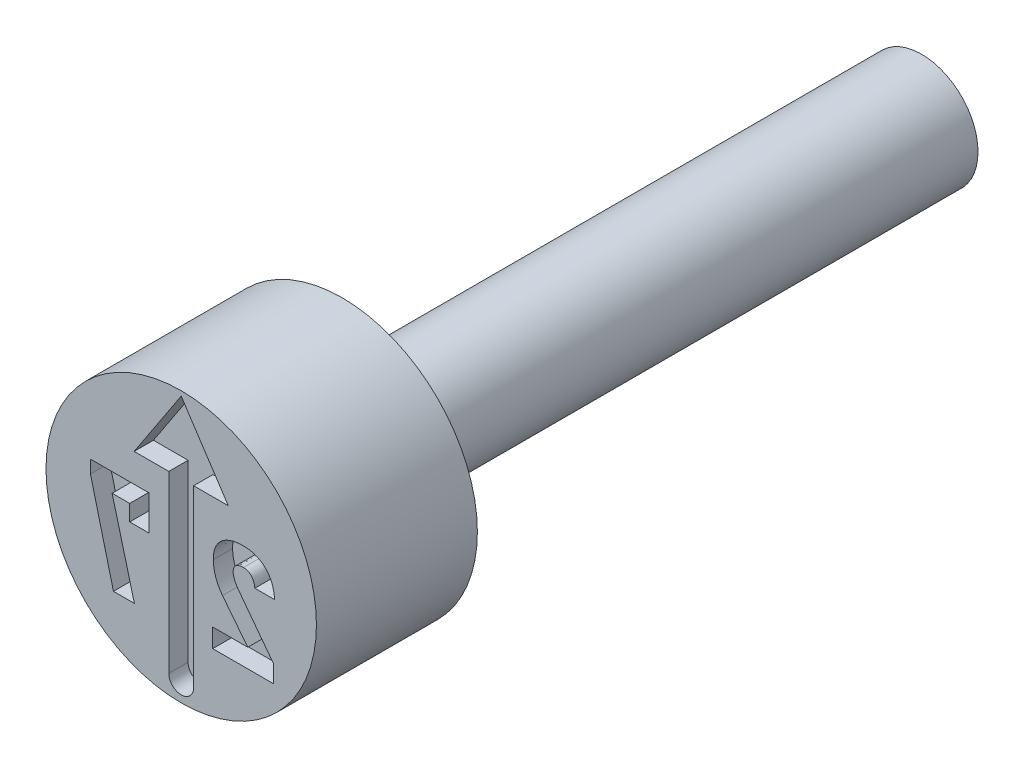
ISO-10303-21;
HEADER;
FILE_DESCRIPTION(('STEP AP214'),'2;1');
FILE_NAME('part.step','',(''),(''),'','','');
FILE_SCHEMA(('AUTOMOTIVE_DESIGN { 1 0 10303 214 1 1 1 1 }'));
ENDSEC;
DATA;
#1=APPLICATION_CONTEXT('core data for automotive mechanical design processes');
#2=APPLICATION_PROTOCOL_DEFINITION('international standard','automotive_design',2000,#1);
#3=PRODUCT_CONTEXT('',#1,'mechanical');
#4=PRODUCT('Part','Part','',(#3));
#5=PRODUCT_RELATED_PRODUCT_CATEGORY('part','',(#4));
#6=PRODUCT_DEFINITION_FORMATION('','',#4);
#7=PRODUCT_DEFINITION_CONTEXT('part definition',#1,'design');
#8=PRODUCT_DEFINITION('design','',#6,#7);
#9=PRODUCT_DEFINITION_SHAPE('','',#8);
#10=(LENGTH_UNIT() NAMED_UNIT(*) SI_UNIT(.MILLI.,.METRE.));
#11=(NAMED_UNIT(*) PLANE_ANGLE_UNIT() SI_UNIT($,.RADIAN.));
#12=(NAMED_UNIT(*) SI_UNIT($,.STERADIAN.) SOLID_ANGLE_UNIT());
#13=UNCERTAINTY_MEASURE_WITH_UNIT(LENGTH_MEASURE(1.E-05),#10,'distance_accuracy_value','');
#14=(GEOMETRIC_REPRESENTATION_CONTEXT(3) GLOBAL_UNCERTAINTY_ASSIGNED_CONTEXT((#13)) GLOBAL_UNIT_ASSIGNED_CONTEXT((#10,
#11,#12)) REPRESENTATION_CONTEXT('',''));
#15=CARTESIAN_POINT('',(0.,0.,0.));
#16=DIRECTION('',(0.,0.,1.));
#17=DIRECTION('',(1.,0.,0.));
#18=AXIS2_PLACEMENT_3D('',#15,#16,#17);
#19=CARTESIAN_POINT('',(0.,1.75,-5.));
#20=DIRECTION('',(0.,0.,1.));
#21=DIRECTION('',(1.,0.,0.));
#22=AXIS2_PLACEMENT_3D('',#19,#20,#21);
#23=PLANE('',#22);
#24=CARTESIAN_POINT('',(0.,0.,-5.));
#25=DIRECTION('',(0.,0.,1.));
#26=DIRECTION('',(1.,0.,0.));
#27=AXIS2_PLACEMENT_3D('',#24,#25,#26);
#28=CIRCLE('',#27,4.2);
#29=CARTESIAN_POINT('',(4.2,0.,-5.));
#30=VERTEX_POINT('',#29);
#31=EDGE_CURVE('E11',#30,#30,#28,.T.);
#32=ORIENTED_EDGE('',*,*,#31,.F.);
#33=EDGE_LOOP('',(#32));
#34=FACE_BOUND('',#33,.T.);
#35=CARTESIAN_POINT('',(0.,0.,-5.));
#36=DIRECTION('',(0.,0.,1.));
#37=DIRECTION('',(1.,0.,0.));
#38=AXIS2_PLACEMENT_3D('',#35,#36,#37);
#39=CIRCLE('',#38,1.75);
#40=CARTESIAN_POINT('',(1.75,0.,-5.));
#41=VERTEX_POINT('',#40);
#42=EDGE_CURVE('E405',#41,#41,#39,.T.);
#43=ORIENTED_EDGE('',*,*,#42,.T.);
#44=EDGE_LOOP('',(#43));
#45=FACE_BOUND('',#44,.T.);
#46=ADVANCED_FACE('F39',(#34,#45),#23,.F.);
#47=CARTESIAN_POINT('',(0.,0.,-0.403888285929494));
#48=DIRECTION('',(0.,0.,1.));
#49=DIRECTION('',(1.,0.,0.));
#50=AXIS2_PLACEMENT_3D('',#47,#48,#49);
#51=CYLINDRICAL_SURFACE('',#50,4.2);
#52=CARTESIAN_POINT('',(0.,0.,0.));
#53=DIRECTION('',(0.,0.,1.));
#54=DIRECTION('',(1.,0.,0.));
#55=AXIS2_PLACEMENT_3D('',#52,#53,#54);
#56=CIRCLE('',#55,4.2);
#57=CARTESIAN_POINT('',(4.2,0.,0.));
#58=VERTEX_POINT('',#57);
#59=EDGE_CURVE('E46',#58,#58,#56,.T.);
#60=ORIENTED_EDGE('',*,*,#59,.F.);
#61=EDGE_LOOP('',(#60));
#62=FACE_BOUND('',#61,.T.);
#63=ORIENTED_EDGE('',*,*,#31,.T.);
#64=EDGE_LOOP('',(#63));
#65=FACE_BOUND('',#64,.T.);
#66=ADVANCED_FACE('F390',(#62,#65),#51,.T.);
#67=CARTESIAN_POINT('',(0.,4.2,0.));
#68=DIRECTION('',(0.,0.,-1.));
#69=DIRECTION('',(-1.,0.,0.));
#70=AXIS2_PLACEMENT_3D('',#67,#68,#69);
#71=PLANE('',#70);
#72=DIRECTION('',(0.,1.,0.));
#73=VECTOR('',#72,1.);
#74=CARTESIAN_POINT('',(2.86298701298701,-2.25,0.));
#75=LINE('',#74,#73);
#76=CARTESIAN_POINT('',(2.86298701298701,-2.25,0.));
#77=VERTEX_POINT('',#76);
#78=CARTESIAN_POINT('',(2.86298701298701,-1.70584415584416,0.));
#79=VERTEX_POINT('',#78);
#80=EDGE_CURVE('E640',#77,#79,#75,.T.);
#81=ORIENTED_EDGE('',*,*,#80,.F.);
#82=DIRECTION('',(1.,0.,0.));
#83=VECTOR('',#82,1.);
#84=CARTESIAN_POINT('',(0.978571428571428,-2.25,0.));
#85=LINE('',#84,#83);
#86=CARTESIAN_POINT('',(0.978571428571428,-2.25,0.));
#87=VERTEX_POINT('',#86);
#88=EDGE_CURVE('E53',#87,#77,#85,.T.);
#89=ORIENTED_EDGE('',*,*,#88,.F.);
#90=DIRECTION('',(0.,-1.,0.));
#91=VECTOR('',#90,1.);
#92=CARTESIAN_POINT('',(0.978571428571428,-1.66818181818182,0.));
#93=LINE('',#92,#91);
#94=CARTESIAN_POINT('',(0.978571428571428,-1.66818181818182,0.));
#95=VERTEX_POINT('',#94);
#96=EDGE_CURVE('E274',#95,#87,#93,.T.);
#97=ORIENTED_EDGE('',*,*,#96,.F.);
#98=DIRECTION('',(-1.,0.,0.));
#99=VECTOR('',#98,1.);
#100=CARTESIAN_POINT('',(2.06753246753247,-1.66818181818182,0.));
#101=LINE('',#100,#99);
#102=CARTESIAN_POINT('',(2.06753246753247,-1.66818181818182,0.));
#103=VERTEX_POINT('',#102);
#104=EDGE_CURVE('E277',#103,#95,#101,.T.);
#105=ORIENTED_EDGE('',*,*,#104,.F.);
#106=DIRECTION('',(0.618183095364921,-0.786034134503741,0.));
#107=VECTOR('',#106,1.);
#108=CARTESIAN_POINT('',(1.28311688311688,-0.67077922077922,0.));
#109=LINE('',#108,#107);
#110=CARTESIAN_POINT('',(1.28311688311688,-0.67077922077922,0.));
#111=VERTEX_POINT('',#110);
#112=EDGE_CURVE('E571',#111,#103,#109,.T.);
#113=ORIENTED_EDGE('',*,*,#112,.F.);
#114=CARTESIAN_POINT('',(0.996103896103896,0.152597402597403,0.));
#115=CARTESIAN_POINT('',(0.996931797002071,0.116187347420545,0.));
#116=CARTESIAN_POINT('',(0.998589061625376,0.0433029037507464,0.));
#117=CARTESIAN_POINT('',(1.01354853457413,-0.0657788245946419,0.));
#118=CARTESIAN_POINT('',(1.03765543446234,-0.174303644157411,0.));
#119=CARTESIAN_POINT('',(1.0707627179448,-0.281747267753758,0.));
#120=CARTESIAN_POINT('',(1.11189043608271,-0.386248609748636,0.));
#121=CARTESIAN_POINT('',(1.16125160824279,-0.486376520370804,0.));
#122=CARTESIAN_POINT('',(1.21696202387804,-0.582175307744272,0.));
#123=CARTESIAN_POINT('',(1.2611074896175,-0.641301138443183,0.));
#124=CARTESIAN_POINT('',(1.28311688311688,-0.67077922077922,0.));
#125=B_SPLINE_CURVE_WITH_KNOTS('',3,(#114,#115,#116,#117,#118,#119,#120,#121,#122,#123,#124),
.UNSPECIFIED.,.F.,.F.,(4,1,1,1,1,1,1,1,4),(0.,0.123046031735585,0.246309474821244,
0.371480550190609,0.498560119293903,0.626024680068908,0.750715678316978,0.875715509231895,1.),.UNSPECIFIED.);
#126=CARTESIAN_POINT('',(0.996103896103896,0.152597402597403,0.));
#127=VERTEX_POINT('',#126);
#128=EDGE_CURVE('E574',#127,#111,#125,.T.);
#129=ORIENTED_EDGE('',*,*,#128,.F.);
#130=DIRECTION('',(0.,-1.,0.));
#131=VECTOR('',#130,1.);
#132=CARTESIAN_POINT('',(0.996103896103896,0.155194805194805,0.));
#133=LINE('',#132,#131);
#134=CARTESIAN_POINT('',(0.996103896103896,0.155194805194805,0.));
#135=VERTEX_POINT('',#134);
#136=EDGE_CURVE('E579',#135,#127,#133,.T.);
#137=ORIENTED_EDGE('',*,*,#136,.F.);
#138=CARTESIAN_POINT('',(1.93831168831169,0.991558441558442,0.));
#139=CARTESIAN_POINT('',(1.90191870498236,0.991041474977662,0.));
#140=CARTESIAN_POINT('',(1.83113916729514,0.990036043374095,0.));
#141=CARTESIAN_POINT('',(1.72809640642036,0.979182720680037,0.));
#142=CARTESIAN_POINT('',(1.63114409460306,0.962801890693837,0.));
#143=CARTESIAN_POINT('',(1.54043824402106,0.938837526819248,0.));
#144=CARTESIAN_POINT('',(1.45634299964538,0.907578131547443,0.));
#145=CARTESIAN_POINT('',(1.37860644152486,0.869886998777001,0.));
#146=CARTESIAN_POINT('',(1.30706606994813,0.825442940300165,0.));
#147=CARTESIAN_POINT('',(1.24226977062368,0.774150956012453,0.));
#148=CARTESIAN_POINT('',(1.18396911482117,0.716942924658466,0.));
#149=CARTESIAN_POINT('',(1.13378797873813,0.653238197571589,0.));
#150=CARTESIAN_POINT('',(1.09034788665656,0.584324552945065,0.));
#151=CARTESIAN_POINT('',(1.05639106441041,0.508865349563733,0.));
#152=CARTESIAN_POINT('',(1.02843507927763,0.42863512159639,0.));
#153=CARTESIAN_POINT('',(1.01033401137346,0.342195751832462,0.));
#154=CARTESIAN_POINT('',(0.998136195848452,0.250564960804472,0.));
#155=CARTESIAN_POINT('',(0.996792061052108,0.18748846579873,0.));
#156=CARTESIAN_POINT('',(0.996103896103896,0.155194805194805,0.));
#157=B_SPLINE_CURVE_WITH_KNOTS('',3,(#138,#139,#140,#141,#142,#143,#144,#145,#146,#147,#148,
#149,#150,#151,#152,#153,#154,#155,#156),.UNSPECIFIED.,.F.,.F.,(4,1,1,1,1,1,1,1,1,1,1,1,1,1,1,1,
4),(0.,0.0762312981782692,0.148259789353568,0.216860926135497,0.28210063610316,
0.344528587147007,0.404571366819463,0.462840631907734,0.520642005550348,0.577409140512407,
0.633580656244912,0.690215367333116,0.747647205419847,0.806597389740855,0.867894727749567,
0.932365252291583,1.),.UNSPECIFIED.);
#158=CARTESIAN_POINT('',(1.93831168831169,0.991558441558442,0.));
#159=VERTEX_POINT('',#158);
#160=EDGE_CURVE('E585',#159,#135,#157,.T.);
#161=ORIENTED_EDGE('',*,*,#160,.F.);
#162=CARTESIAN_POINT('',(2.9025974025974,0.0311688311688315,0.));
#163=CARTESIAN_POINT('',(2.89955987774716,0.0682613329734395,0.));
#164=CARTESIAN_POINT('',(2.8936306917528,0.140665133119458,0.));
#165=CARTESIAN_POINT('',(2.87419224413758,0.245400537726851,0.));
#166=CARTESIAN_POINT('',(2.84906881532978,0.344054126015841,0.));
#167=CARTESIAN_POINT('',(2.81710842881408,0.436606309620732,0.));
#168=CARTESIAN_POINT('',(2.77603921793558,0.521985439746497,0.));
#169=CARTESIAN_POINT('',(2.72989671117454,0.601976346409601,0.));
#170=CARTESIAN_POINT('',(2.67439883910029,0.674104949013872,0.));
#171=CARTESIAN_POINT('',(2.61364864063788,0.740784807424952,0.));
#172=CARTESIAN_POINT('',(2.54598378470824,0.799515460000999,0.));
#173=CARTESIAN_POINT('',(2.47383445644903,0.85132377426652,0.));
#174=CARTESIAN_POINT('',(2.39610964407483,0.894436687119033,0.));
#175=CARTESIAN_POINT('',(2.31399097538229,0.930201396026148,0.));
#176=CARTESIAN_POINT('',(2.22656798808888,0.957345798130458,0.));
#177=CARTESIAN_POINT('',(2.13498263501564,0.977679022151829,0.));
#178=CARTESIAN_POINT('',(2.03818368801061,0.989405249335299,0.));
#179=CARTESIAN_POINT('',(1.97210928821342,0.990829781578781,0.));
#180=CARTESIAN_POINT('',(1.93831168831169,0.991558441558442,0.));
#181=B_SPLINE_CURVE_WITH_KNOTS('',3,(#162,#163,#164,#165,#166,#167,#168,#169,#170,#171,#172,
#173,#174,#175,#176,#177,#178,#179,#180),.UNSPECIFIED.,.F.,.F.,(4,1,1,1,1,1,1,1,1,1,1,1,1,1,1,1,
4),(0.,0.0733268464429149,0.14313249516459,0.209679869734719,0.273918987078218,0.33576228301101,
0.396210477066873,0.45560885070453,0.514796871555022,0.573764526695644,0.631900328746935,
0.689592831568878,0.748648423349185,0.808163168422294,0.86976604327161,0.933384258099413,1.),.UNSPECIFIED.);
#182=CARTESIAN_POINT('',(2.9025974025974,0.0311688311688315,0.));
#183=VERTEX_POINT('',#182);
#184=EDGE_CURVE('E590',#183,#159,#181,.T.);
#185=ORIENTED_EDGE('',*,*,#184,.F.);
#186=DIRECTION('',(0.,1.,0.));
#187=VECTOR('',#186,1.);
#188=CARTESIAN_POINT('',(2.9025974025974,0.0292207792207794,0.));
#189=LINE('',#188,#187);
#190=CARTESIAN_POINT('',(2.9025974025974,0.0292207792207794,0.));
#191=VERTEX_POINT('',#190);
#192=EDGE_CURVE('E598',#191,#183,#189,.T.);
#193=ORIENTED_EDGE('',*,*,#192,.F.);
#194=DIRECTION('',(1.,0.,0.));
#195=VECTOR('',#194,1.);
#196=CARTESIAN_POINT('',(2.28701298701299,0.0292207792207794,0.));
#197=LINE('',#196,#195);
#198=CARTESIAN_POINT('',(2.28701298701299,0.0292207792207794,0.));
#199=VERTEX_POINT('',#198);
#200=EDGE_CURVE('E604',#199,#191,#197,.T.);
#201=ORIENTED_EDGE('',*,*,#200,.F.);
#202=DIRECTION('',(0.,-1.,0.));
#203=VECTOR('',#202,1.);
#204=CARTESIAN_POINT('',(2.28701298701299,0.0311688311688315,0.));
#205=LINE('',#204,#203);
#206=CARTESIAN_POINT('',(2.28701298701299,0.0311688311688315,0.));
#207=VERTEX_POINT('',#206);
#208=EDGE_CURVE('E607',#207,#199,#205,.T.);
#209=ORIENTED_EDGE('',*,*,#208,.F.);
#210=CARTESIAN_POINT('',(1.93376623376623,0.40974025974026,0.));
#211=CARTESIAN_POINT('',(1.95729092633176,0.408822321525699,0.));
#212=CARTESIAN_POINT('',(2.00300022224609,0.407038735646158,0.));
#213=CARTESIAN_POINT('',(2.06770952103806,0.38727157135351,0.));
#214=CARTESIAN_POINT('',(2.12601890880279,0.356265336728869,0.));
#215=CARTESIAN_POINT('',(2.17628623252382,0.312023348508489,0.));
#216=CARTESIAN_POINT('',(2.21791138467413,0.25647586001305,0.));
#217=CARTESIAN_POINT('',(2.25169422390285,0.191064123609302,0.));
#218=CARTESIAN_POINT('',(2.27463927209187,0.114607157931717,0.));
#219=CARTESIAN_POINT('',(2.28275569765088,0.059876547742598,0.));
#220=CARTESIAN_POINT('',(2.28701298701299,0.0311688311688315,0.));
#221=B_SPLINE_CURVE_WITH_KNOTS('',3,(#210,#211,#212,#213,#214,#215,#216,#217,#218,#219,#220),
.UNSPECIFIED.,.F.,.F.,(4,1,1,1,1,1,1,1,4),(0.,0.122603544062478,0.238222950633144,
0.350089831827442,0.465559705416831,0.58502806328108,0.711014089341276,0.848418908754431,1.),.UNSPECIFIED.);
#222=CARTESIAN_POINT('',(1.93376623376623,0.40974025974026,0.));
#223=VERTEX_POINT('',#222);
#224=EDGE_CURVE('E610',#223,#207,#221,.T.);
#225=ORIENTED_EDGE('',*,*,#224,.F.);
#226=CARTESIAN_POINT('',(1.61428571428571,0.138311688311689,0.));
#227=CARTESIAN_POINT('',(1.61517276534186,0.158772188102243,0.));
#228=CARTESIAN_POINT('',(1.61687221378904,0.19797124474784,0.));
#229=CARTESIAN_POINT('',(1.63288368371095,0.253203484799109,0.));
#230=CARTESIAN_POINT('',(1.65912562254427,0.30130232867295,0.));
#231=CARTESIAN_POINT('',(1.69671041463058,0.341031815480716,0.));
#232=CARTESIAN_POINT('',(1.74350060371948,0.372455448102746,0.));
#233=CARTESIAN_POINT('',(1.7994863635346,0.394600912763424,0.));
#234=CARTESIAN_POINT('',(1.8639351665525,0.407299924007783,0.));
#235=CARTESIAN_POINT('',(1.90968069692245,0.408898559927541,0.));
#236=CARTESIAN_POINT('',(1.93376623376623,0.40974025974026,0.));
#237=B_SPLINE_CURVE_WITH_KNOTS('',3,(#226,#227,#228,#229,#230,#231,#232,#233,#234,#235,#236),
.UNSPECIFIED.,.F.,.F.,(4,1,1,1,1,1,1,1,4),(0.,0.128749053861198,0.246662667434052,
0.359069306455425,0.47107757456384,0.588039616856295,0.711712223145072,0.848213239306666,1.),.UNSPECIFIED.);
#238=CARTESIAN_POINT('',(1.61428571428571,0.138311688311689,0.));
#239=VERTEX_POINT('',#238);
#240=EDGE_CURVE('E615',#239,#223,#237,.T.);
#241=ORIENTED_EDGE('',*,*,#240,.F.);
#242=DIRECTION('',(0.,1.,0.));
#243=VECTOR('',#242,1.);
#244=CARTESIAN_POINT('',(1.61428571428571,0.133766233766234,0.));
#245=LINE('',#244,#243);
#246=CARTESIAN_POINT('',(1.61428571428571,0.133766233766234,0.));
#247=VERTEX_POINT('',#246);
#248=EDGE_CURVE('E623',#247,#239,#245,.T.);
#249=ORIENTED_EDGE('',*,*,#248,.F.);
#250=CARTESIAN_POINT('',(1.76948051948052,-0.257142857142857,0.));
#251=CARTESIAN_POINT('',(1.74657683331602,-0.224870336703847,0.));
#252=CARTESIAN_POINT('',(1.70194969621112,-0.161988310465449,0.));
#253=CARTESIAN_POINT('',(1.66155869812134,-0.0756325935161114,0.));
#254=CARTESIAN_POINT('',(1.6363967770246,-0.00792863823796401,0.));
#255=CARTESIAN_POINT('',(1.62440516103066,0.0411700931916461,0.));
#256=CARTESIAN_POINT('',(1.61585071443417,0.0880148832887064,0.));
#257=CARTESIAN_POINT('',(1.61479780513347,0.118795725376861,0.));
#258=CARTESIAN_POINT('',(1.61428571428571,0.133766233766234,0.));
#259=B_SPLINE_CURVE_WITH_KNOTS('',3,(#250,#251,#252,#253,#254,#255,#256,#257,#258),
.UNSPECIFIED.,.F.,.F.,(4,1,1,1,1,1,4),(0.,0.277375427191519,0.540457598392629,0.666416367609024,
0.784009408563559,0.894951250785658,1.),.UNSPECIFIED.);
#260=CARTESIAN_POINT('',(1.76948051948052,-0.257142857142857,0.));
#261=VERTEX_POINT('',#260);
#262=EDGE_CURVE('E629',#261,#247,#259,.T.);
#263=ORIENTED_EDGE('',*,*,#262,.F.);
#264=DIRECTION('',(-0.602458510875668,0.798150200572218,0.));
#265=VECTOR('',#264,1.);
#266=CARTESIAN_POINT('',(2.86298701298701,-1.70584415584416,0.));
#267=LINE('',#266,#265);
#268=EDGE_CURVE('E634',#79,#261,#267,.T.);
#269=ORIENTED_EDGE('',*,*,#268,.F.);
#270=EDGE_LOOP('',(#81,#89,#97,#105,#113,#129,#137,#161,#185,#193,#201,#209,#225,#241,#249,#263,#269));
#271=FACE_BOUND('',#270,.T.);
#272=DIRECTION('',(0.,-1.,0.));
#273=VECTOR('',#272,1.);
#274=CARTESIAN_POINT('',(-2.81927272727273,0.95,0.));
#275=LINE('',#274,#273);
#276=CARTESIAN_POINT('',(-2.81927272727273,0.95,0.));
#277=VERTEX_POINT('',#276);
#278=CARTESIAN_POINT('',(-2.81927272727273,0.548701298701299,0.));
#279=VERTEX_POINT('',#278);
#280=EDGE_CURVE('E510',#277,#279,#275,.T.);
#281=ORIENTED_EDGE('',*,*,#280,.F.);
#282=DIRECTION('',(-1.,0.,0.));
#283=VECTOR('',#282,1.);
#284=CARTESIAN_POINT('',(-0.998493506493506,0.95,0.));
#285=LINE('',#284,#283);
#286=CARTESIAN_POINT('',(-0.998493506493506,0.95,0.));
#287=VERTEX_POINT('',#286);
#288=EDGE_CURVE('E61',#287,#277,#285,.T.);
#289=ORIENTED_EDGE('',*,*,#288,.F.);
#290=DIRECTION('',(0.,1.,0.));
#291=VECTOR('',#290,1.);
#292=CARTESIAN_POINT('',(-0.998493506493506,-0.13051948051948,0.));
#293=LINE('',#292,#291);
#294=CARTESIAN_POINT('',(-0.998493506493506,-0.13051948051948,0.));
#295=VERTEX_POINT('',#294);
#296=EDGE_CURVE('E488',#295,#287,#293,.T.);
#297=ORIENTED_EDGE('',*,*,#296,.F.);
#298=DIRECTION('',(1.,0.,0.));
#299=VECTOR('',#298,1.);
#300=CARTESIAN_POINT('',(-1.59914285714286,-0.13051948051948,0.));
#301=LINE('',#300,#299);
#302=CARTESIAN_POINT('',(-1.59914285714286,-0.13051948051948,0.));
#303=VERTEX_POINT('',#302);
#304=EDGE_CURVE('E492',#303,#295,#301,.T.);
#305=ORIENTED_EDGE('',*,*,#304,.F.);
#306=DIRECTION('',(0.,-1.,0.));
#307=VECTOR('',#306,1.);
#308=CARTESIAN_POINT('',(-1.59914285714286,0.368181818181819,0.));
#309=LINE('',#308,#307);
#310=CARTESIAN_POINT('',(-1.59914285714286,0.368181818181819,0.));
#311=VERTEX_POINT('',#310);
#312=EDGE_CURVE('E495',#311,#303,#309,.T.);
#313=ORIENTED_EDGE('',*,*,#312,.F.);
#314=DIRECTION('',(1.,0.,0.));
#315=VECTOR('',#314,1.);
#316=CARTESIAN_POINT('',(-2.14654545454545,0.368181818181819,0.));
#317=LINE('',#316,#315);
#318=CARTESIAN_POINT('',(-2.14654545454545,0.368181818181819,0.));
#319=VERTEX_POINT('',#318);
#320=EDGE_CURVE('E498',#319,#311,#317,.T.);
#321=ORIENTED_EDGE('',*,*,#320,.F.);
#322=DIRECTION('',(-0.255602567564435,0.966781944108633,0.));
#323=VECTOR('',#322,1.);
#324=CARTESIAN_POINT('',(-1.45433766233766,-2.25,0.));
#325=LINE('',#324,#323);
#326=CARTESIAN_POINT('',(-1.45433766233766,-2.25,0.));
#327=VERTEX_POINT('',#326);
#328=EDGE_CURVE('E501',#327,#319,#325,.T.);
#329=ORIENTED_EDGE('',*,*,#328,.F.);
#330=DIRECTION('',(1.,0.,0.));
#331=VECTOR('',#330,1.);
#332=CARTESIAN_POINT('',(-2.10498701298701,-2.25,0.));
#333=LINE('',#332,#331);
#334=CARTESIAN_POINT('',(-2.10498701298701,-2.25,0.));
#335=VERTEX_POINT('',#334);
#336=EDGE_CURVE('E504',#335,#327,#333,.T.);
#337=ORIENTED_EDGE('',*,*,#336,.F.);
#338=DIRECTION('',(0.247293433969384,-0.968940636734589,0.));
#339=VECTOR('',#338,1.);
#340=CARTESIAN_POINT('',(-2.81927272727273,0.548701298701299,0.));
#341=LINE('',#340,#339);
#342=EDGE_CURVE('E507',#279,#335,#341,.T.);
#343=ORIENTED_EDGE('',*,*,#342,.F.);
#344=EDGE_LOOP('',(#281,#289,#297,#305,#313,#321,#329,#337,#343));
#345=FACE_BOUND('',#344,.T.);
#346=DIRECTION('',(0.,1.,0.));
#347=VECTOR('',#346,1.);
#348=CARTESIAN_POINT('',(0.385708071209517,1.83536164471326,0.));
#349=LINE('',#348,#347);
#350=CARTESIAN_POINT('',(0.385708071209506,-3.59672771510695,0.));
#351=VERTEX_POINT('',#350);
#352=CARTESIAN_POINT('',(0.385708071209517,1.83536164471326,0.));
#353=VERTEX_POINT('',#352);
#354=EDGE_CURVE('E444',#351,#353,#349,.T.);
#355=ORIENTED_EDGE('',*,*,#354,.F.);
#356=CARTESIAN_POINT('',(3.30934598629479E-13,-3.59672771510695,0.));
#357=DIRECTION('',(0.,0.,1.));
#358=DIRECTION('',(1.,0.,0.));
#359=AXIS2_PLACEMENT_3D('',#356,#357,#358);
#360=CIRCLE('',#359,0.385708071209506);
#361=CARTESIAN_POINT('',(-0.385708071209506,-3.59672771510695,0.));
#362=VERTEX_POINT('',#361);
#363=EDGE_CURVE('E447',#362,#351,#360,.T.);
#364=ORIENTED_EDGE('',*,*,#363,.F.);
#365=DIRECTION('',(0.,-1.,0.));
#366=VECTOR('',#365,1.);
#367=CARTESIAN_POINT('',(-0.385708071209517,1.83536164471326,0.));
#368=LINE('',#367,#366);
#369=CARTESIAN_POINT('',(-0.385708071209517,1.83536164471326,0.));
#370=VERTEX_POINT('',#369);
#371=EDGE_CURVE('E428',#370,#362,#368,.T.);
#372=ORIENTED_EDGE('',*,*,#371,.F.);
#373=DIRECTION('',(1.,0.,0.));
#374=VECTOR('',#373,1.);
#375=CARTESIAN_POINT('',(-1.46188328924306,1.83536164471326,0.));
#376=LINE('',#375,#374);
#377=CARTESIAN_POINT('',(-1.46188328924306,1.83536164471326,0.));
#378=VERTEX_POINT('',#377);
#379=EDGE_CURVE('E432',#378,#370,#376,.T.);
#380=ORIENTED_EDGE('',*,*,#379,.F.);
#381=DIRECTION('',(-0.550159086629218,-0.835059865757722,0.));
#382=VECTOR('',#381,1.);
#383=CARTESIAN_POINT('',(0.,4.05428357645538,0.));
#384=LINE('',#383,#382);
#385=CARTESIAN_POINT('',(0.,4.05428357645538,0.));
#386=VERTEX_POINT('',#385);
#387=EDGE_CURVE('E435',#386,#378,#384,.T.);
#388=ORIENTED_EDGE('',*,*,#387,.F.);
#389=DIRECTION('',(-0.550159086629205,0.835059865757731,0.));
#390=VECTOR('',#389,1.);
#391=CARTESIAN_POINT('',(0.,4.05428357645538,0.));
#392=LINE('',#391,#390);
#393=CARTESIAN_POINT('',(1.46188328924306,1.83536164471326,0.));
#394=VERTEX_POINT('',#393);
#395=EDGE_CURVE('E438',#394,#386,#392,.T.);
#396=ORIENTED_EDGE('',*,*,#395,.F.);
#397=DIRECTION('',(1.,0.,0.));
#398=VECTOR('',#397,1.);
#399=CARTESIAN_POINT('',(1.46188328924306,1.83536164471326,0.));
#400=LINE('',#399,#398);
#401=EDGE_CURVE('E441',#353,#394,#400,.T.);
#402=ORIENTED_EDGE('',*,*,#401,.F.);
#403=EDGE_LOOP('',(#355,#364,#372,#380,#388,#396,#402));
#404=FACE_BOUND('',#403,.T.);
#405=ORIENTED_EDGE('',*,*,#59,.T.);
#406=EDGE_LOOP('',(#405));
#407=FACE_BOUND('',#406,.T.);
#408=ADVANCED_FACE('F387',(#271,#345,#404,#407),#71,.F.);
#409=CARTESIAN_POINT('',(0.,0.,-23.));
#410=DIRECTION('',(0.,0.,1.));
#411=DIRECTION('',(1.,0.,0.));
#412=AXIS2_PLACEMENT_3D('',#409,#410,#411);
#413=PLANE('',#412);
#414=CARTESIAN_POINT('',(0.,0.,-23.));
#415=DIRECTION('',(0.,0.,1.));
#416=DIRECTION('',(1.,0.,0.));
#417=AXIS2_PLACEMENT_3D('',#414,#415,#416);
#418=CIRCLE('',#417,1.75);
#419=CARTESIAN_POINT('',(1.75,0.,-23.));
#420=VERTEX_POINT('',#419);
#421=EDGE_CURVE('E406',#420,#420,#418,.T.);
#422=ORIENTED_EDGE('',*,*,#421,.F.);
#423=EDGE_LOOP('',(#422));
#424=FACE_BOUND('',#423,.T.);
#425=ADVANCED_FACE('F383',(#424),#413,.F.);
#426=CARTESIAN_POINT('',(0.,0.,-0.403888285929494));
#427=DIRECTION('',(0.,0.,1.));
#428=DIRECTION('',(1.,0.,0.));
#429=AXIS2_PLACEMENT_3D('',#426,#427,#428);
#430=CYLINDRICAL_SURFACE('',#429,1.75);
#431=ORIENTED_EDGE('',*,*,#42,.F.);
#432=EDGE_LOOP('',(#431));
#433=FACE_BOUND('',#432,.T.);
#434=ORIENTED_EDGE('',*,*,#421,.T.);
#435=EDGE_LOOP('',(#434));
#436=FACE_BOUND('',#435,.T.);
#437=ADVANCED_FACE('F379',(#433,#436),#430,.T.);
#438=CARTESIAN_POINT('',(3.30934598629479E-13,-3.59672771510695,-0.6));
#439=DIRECTION('',(0.,0.,1.));
#440=DIRECTION('',(1.,0.,0.));
#441=AXIS2_PLACEMENT_3D('',#438,#439,#440);
#442=CYLINDRICAL_SURFACE('',#441,0.385708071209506);
#443=ORIENTED_EDGE('',*,*,#363,.T.);
#444=DIRECTION('',(0.,0.,1.));
#445=VECTOR('',#444,1.);
#446=CARTESIAN_POINT('',(0.385708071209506,-3.59672771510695,-0.6));
#447=LINE('',#446,#445);
#448=CARTESIAN_POINT('',(0.385708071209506,-3.59672771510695,-0.6));
#449=VERTEX_POINT('',#448);
#450=EDGE_CURVE('E414',#449,#351,#447,.T.);
#451=ORIENTED_EDGE('',*,*,#450,.F.);
#452=CARTESIAN_POINT('',(3.30934598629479E-13,-3.59672771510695,-0.6));
#453=DIRECTION('',(0.,0.,1.));
#454=DIRECTION('',(1.,0.,0.));
#455=AXIS2_PLACEMENT_3D('',#452,#453,#454);
#456=CIRCLE('',#455,0.385708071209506);
#457=CARTESIAN_POINT('',(-0.385708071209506,-3.59672771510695,-0.6));
#458=VERTEX_POINT('',#457);
#459=EDGE_CURVE('E431',#458,#449,#456,.T.);
#460=ORIENTED_EDGE('',*,*,#459,.F.);
#461=DIRECTION('',(0.,0.,1.));
#462=VECTOR('',#461,1.);
#463=CARTESIAN_POINT('',(-0.385708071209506,-3.59672771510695,-0.6));
#464=LINE('',#463,#462);
#465=EDGE_CURVE('E407',#458,#362,#464,.T.);
#466=ORIENTED_EDGE('',*,*,#465,.T.);
#467=EDGE_LOOP('',(#443,#451,#460,#466));
#468=FACE_BOUND('',#467,.T.);
#469=ADVANCED_FACE('F357',(#468),#442,.F.);
#470=CARTESIAN_POINT('',(-0.385708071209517,1.83536164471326,-0.6));
#471=DIRECTION('',(-1.,0.,0.));
#472=DIRECTION('',(0.,-1.,0.));
#473=AXIS2_PLACEMENT_3D('',#470,#471,#472);
#474=PLANE('',#473);
#475=ORIENTED_EDGE('',*,*,#371,.T.);
#476=ORIENTED_EDGE('',*,*,#465,.F.);
#477=DIRECTION('',(0.,-1.,0.));
#478=VECTOR('',#477,1.);
#479=CARTESIAN_POINT('',(-0.385708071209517,1.83536164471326,-0.6));
#480=LINE('',#479,#478);
#481=CARTESIAN_POINT('',(-0.385708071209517,1.83536164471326,-0.6));
#482=VERTEX_POINT('',#481);
#483=EDGE_CURVE('E419',#482,#458,#480,.T.);
#484=ORIENTED_EDGE('',*,*,#483,.F.);
#485=DIRECTION('',(0.,0.,1.));
#486=VECTOR('',#485,1.);
#487=CARTESIAN_POINT('',(-0.385708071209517,1.83536164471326,-0.6));
#488=LINE('',#487,#486);
#489=EDGE_CURVE('E411',#482,#370,#488,.T.);
#490=ORIENTED_EDGE('',*,*,#489,.T.);
#491=EDGE_LOOP('',(#475,#476,#484,#490));
#492=FACE_BOUND('',#491,.T.);
#493=ADVANCED_FACE('F353',(#492),#474,.F.);
#494=CARTESIAN_POINT('',(-1.46188328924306,1.83536164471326,-0.6));
#495=DIRECTION('',(0.,-1.,0.));
#496=DIRECTION('',(0.,0.,-1.));
#497=AXIS2_PLACEMENT_3D('',#494,#495,#496);
#498=PLANE('',#497);
#499=ORIENTED_EDGE('',*,*,#379,.T.);
#500=ORIENTED_EDGE('',*,*,#489,.F.);
#501=DIRECTION('',(1.,0.,0.));
#502=VECTOR('',#501,1.);
#503=CARTESIAN_POINT('',(-1.46188328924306,1.83536164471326,-0.6));
#504=LINE('',#503,#502);
#505=CARTESIAN_POINT('',(-1.46188328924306,1.83536164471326,-0.6));
#506=VERTEX_POINT('',#505);
#507=EDGE_CURVE('E452',#506,#482,#504,.T.);
#508=ORIENTED_EDGE('',*,*,#507,.F.);
#509=DIRECTION('',(0.,0.,1.));
#510=VECTOR('',#509,1.);
#511=CARTESIAN_POINT('',(-1.46188328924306,1.83536164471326,-0.6));
#512=LINE('',#511,#510);
#513=EDGE_CURVE('E425',#506,#378,#512,.T.);
#514=ORIENTED_EDGE('',*,*,#513,.T.);
#515=EDGE_LOOP('',(#499,#500,#508,#514));
#516=FACE_BOUND('',#515,.T.);
#517=ADVANCED_FACE('F356',(#516),#498,.F.);
#518=CARTESIAN_POINT('',(0.,4.05428357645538,-0.6));
#519=DIRECTION('',(-0.835059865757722,0.550159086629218,0.));
#520=DIRECTION('',(-0.550159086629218,-0.835059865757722,0.));
#521=AXIS2_PLACEMENT_3D('',#518,#519,#520);
#522=PLANE('',#521);
#523=ORIENTED_EDGE('',*,*,#387,.T.);
#524=ORIENTED_EDGE('',*,*,#513,.F.);
#525=DIRECTION('',(-0.550159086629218,-0.835059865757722,0.));
#526=VECTOR('',#525,1.);
#527=CARTESIAN_POINT('',(0.,4.05428357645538,-0.6));
#528=LINE('',#527,#526);
#529=CARTESIAN_POINT('',(0.,4.05428357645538,-0.6));
#530=VERTEX_POINT('',#529);
#531=EDGE_CURVE('E455',#530,#506,#528,.T.);
#532=ORIENTED_EDGE('',*,*,#531,.F.);
#533=DIRECTION('',(0.,0.,1.));
#534=VECTOR('',#533,1.);
#535=CARTESIAN_POINT('',(0.,4.05428357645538,-0.6));
#536=LINE('',#535,#534);
#537=EDGE_CURVE('E423',#530,#386,#536,.T.);
#538=ORIENTED_EDGE('',*,*,#537,.T.);
#539=EDGE_LOOP('',(#523,#524,#532,#538));
#540=FACE_BOUND('',#539,.T.);
#541=ADVANCED_FACE('F361',(#540),#522,.F.);
#542=CARTESIAN_POINT('',(0.,4.05428357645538,-0.6));
#543=DIRECTION('',(0.835059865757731,0.550159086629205,0.));
#544=DIRECTION('',(-0.550159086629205,0.835059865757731,0.));
#545=AXIS2_PLACEMENT_3D('',#542,#543,#544);
#546=PLANE('',#545);
#547=ORIENTED_EDGE('',*,*,#395,.T.);
#548=ORIENTED_EDGE('',*,*,#537,.F.);
#549=DIRECTION('',(-0.550159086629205,0.835059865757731,0.));
#550=VECTOR('',#549,1.);
#551=CARTESIAN_POINT('',(0.,4.05428357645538,-0.6));
#552=LINE('',#551,#550);
#553=CARTESIAN_POINT('',(1.46188328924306,1.83536164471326,-0.6));
#554=VERTEX_POINT('',#553);
#555=EDGE_CURVE('E458',#554,#530,#552,.T.);
#556=ORIENTED_EDGE('',*,*,#555,.F.);
#557=DIRECTION('',(0.,0.,1.));
#558=VECTOR('',#557,1.);
#559=CARTESIAN_POINT('',(1.46188328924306,1.83536164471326,-0.6));
#560=LINE('',#559,#558);
#561=EDGE_CURVE('E421',#554,#394,#560,.T.);
#562=ORIENTED_EDGE('',*,*,#561,.T.);
#563=EDGE_LOOP('',(#547,#548,#556,#562));
#564=FACE_BOUND('',#563,.T.);
#565=ADVANCED_FACE('F365',(#564),#546,.F.);
#566=CARTESIAN_POINT('',(1.46188328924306,1.83536164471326,-0.6));
#567=DIRECTION('',(0.,-1.,0.));
#568=DIRECTION('',(0.,0.,-1.));
#569=AXIS2_PLACEMENT_3D('',#566,#567,#568);
#570=PLANE('',#569);
#571=ORIENTED_EDGE('',*,*,#401,.T.);
#572=ORIENTED_EDGE('',*,*,#561,.F.);
#573=DIRECTION('',(1.,0.,0.));
#574=VECTOR('',#573,1.);
#575=CARTESIAN_POINT('',(1.46188328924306,1.83536164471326,-0.6));
#576=LINE('',#575,#574);
#577=CARTESIAN_POINT('',(0.385708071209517,1.83536164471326,-0.6));
#578=VERTEX_POINT('',#577);
#579=EDGE_CURVE('E461',#578,#554,#576,.T.);
#580=ORIENTED_EDGE('',*,*,#579,.F.);
#581=DIRECTION('',(0.,0.,1.));
#582=VECTOR('',#581,1.);
#583=CARTESIAN_POINT('',(0.385708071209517,1.83536164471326,-0.6));
#584=LINE('',#583,#582);
#585=EDGE_CURVE('E418',#578,#353,#584,.T.);
#586=ORIENTED_EDGE('',*,*,#585,.T.);
#587=EDGE_LOOP('',(#571,#572,#580,#586));
#588=FACE_BOUND('',#587,.T.);
#589=ADVANCED_FACE('F369',(#588),#570,.F.);
#590=CARTESIAN_POINT('',(0.385708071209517,1.83536164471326,-0.6));
#591=DIRECTION('',(1.,0.,0.));
#592=DIRECTION('',(0.,1.,0.));
#593=AXIS2_PLACEMENT_3D('',#590,#591,#592);
#594=PLANE('',#593);
#595=ORIENTED_EDGE('',*,*,#354,.T.);
#596=ORIENTED_EDGE('',*,*,#585,.F.);
#597=DIRECTION('',(0.,1.,0.));
#598=VECTOR('',#597,1.);
#599=CARTESIAN_POINT('',(0.385708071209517,1.83536164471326,-0.6));
#600=LINE('',#599,#598);
#601=EDGE_CURVE('E464',#449,#578,#600,.T.);
#602=ORIENTED_EDGE('',*,*,#601,.F.);
#603=ORIENTED_EDGE('',*,*,#450,.T.);
#604=EDGE_LOOP('',(#595,#596,#602,#603));
#605=FACE_BOUND('',#604,.T.);
#606=ADVANCED_FACE('F351',(#605),#594,.F.);
#607=CARTESIAN_POINT('',(3.30934598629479E-13,-3.59672771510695,-0.6));
#608=DIRECTION('',(0.,0.,1.));
#609=DIRECTION('',(1.,0.,0.));
#610=AXIS2_PLACEMENT_3D('',#607,#608,#609);
#611=PLANE('',#610);
#612=ORIENTED_EDGE('',*,*,#459,.T.);
#613=ORIENTED_EDGE('',*,*,#601,.T.);
#614=ORIENTED_EDGE('',*,*,#579,.T.);
#615=ORIENTED_EDGE('',*,*,#555,.T.);
#616=ORIENTED_EDGE('',*,*,#531,.T.);
#617=ORIENTED_EDGE('',*,*,#507,.T.);
#618=ORIENTED_EDGE('',*,*,#483,.T.);
#619=EDGE_LOOP('',(#612,#613,#614,#615,#616,#617,#618));
#620=FACE_BOUND('',#619,.T.);
#621=ADVANCED_FACE('F348',(#620),#611,.T.);
#622=CARTESIAN_POINT('',(-0.998493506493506,0.95,-0.6));
#623=DIRECTION('',(0.,1.,0.));
#624=DIRECTION('',(0.,0.,1.));
#625=AXIS2_PLACEMENT_3D('',#622,#623,#624);
#626=PLANE('',#625);
#627=ORIENTED_EDGE('',*,*,#288,.T.);
#628=DIRECTION('',(0.,0.,1.));
#629=VECTOR('',#628,1.);
#630=CARTESIAN_POINT('',(-2.81927272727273,0.95,-0.6));
#631=LINE('',#630,#629);
#632=CARTESIAN_POINT('',(-2.81927272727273,0.95,-0.6));
#633=VERTEX_POINT('',#632);
#634=EDGE_CURVE('E469',#633,#277,#631,.T.);
#635=ORIENTED_EDGE('',*,*,#634,.F.);
#636=DIRECTION('',(-1.,0.,0.));
#637=VECTOR('',#636,1.);
#638=CARTESIAN_POINT('',(-0.998493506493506,0.95,-0.6));
#639=LINE('',#638,#637);
#640=CARTESIAN_POINT('',(-0.998493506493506,0.95,-0.6));
#641=VERTEX_POINT('',#640);
#642=EDGE_CURVE('E491',#641,#633,#639,.T.);
#643=ORIENTED_EDGE('',*,*,#642,.F.);
#644=DIRECTION('',(0.,0.,1.));
#645=VECTOR('',#644,1.);
#646=CARTESIAN_POINT('',(-0.998493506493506,0.95,-0.6));
#647=LINE('',#646,#645);
#648=EDGE_CURVE('E486',#641,#287,#647,.T.);
#649=ORIENTED_EDGE('',*,*,#648,.T.);
#650=EDGE_LOOP('',(#627,#635,#643,#649));
#651=FACE_BOUND('',#650,.T.);
#652=ADVANCED_FACE('F318',(#651),#626,.F.);
#653=CARTESIAN_POINT('',(-0.998493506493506,-0.13051948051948,-0.6));
#654=DIRECTION('',(1.,0.,0.));
#655=DIRECTION('',(0.,0.,-1.));
#656=AXIS2_PLACEMENT_3D('',#653,#654,#655);
#657=PLANE('',#656);
#658=ORIENTED_EDGE('',*,*,#296,.T.);
#659=ORIENTED_EDGE('',*,*,#648,.F.);
#660=DIRECTION('',(0.,1.,0.));
#661=VECTOR('',#660,1.);
#662=CARTESIAN_POINT('',(-0.998493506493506,-0.13051948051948,-0.6));
#663=LINE('',#662,#661);
#664=CARTESIAN_POINT('',(-0.998493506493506,-0.13051948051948,-0.6));
#665=VERTEX_POINT('',#664);
#666=EDGE_CURVE('E472',#665,#641,#663,.T.);
#667=ORIENTED_EDGE('',*,*,#666,.F.);
#668=DIRECTION('',(0.,0.,1.));
#669=VECTOR('',#668,1.);
#670=CARTESIAN_POINT('',(-0.998493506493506,-0.13051948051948,-0.6));
#671=LINE('',#670,#669);
#672=EDGE_CURVE('E484',#665,#295,#671,.T.);
#673=ORIENTED_EDGE('',*,*,#672,.T.);
#674=EDGE_LOOP('',(#658,#659,#667,#673));
#675=FACE_BOUND('',#674,.T.);
#676=ADVANCED_FACE('F314',(#675),#657,.F.);
#677=CARTESIAN_POINT('',(-1.59914285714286,-0.13051948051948,-0.6));
#678=DIRECTION('',(0.,-1.,0.));
#679=DIRECTION('',(0.,0.,-1.));
#680=AXIS2_PLACEMENT_3D('',#677,#678,#679);
#681=PLANE('',#680);
#682=ORIENTED_EDGE('',*,*,#304,.T.);
#683=ORIENTED_EDGE('',*,*,#672,.F.);
#684=DIRECTION('',(1.,0.,0.));
#685=VECTOR('',#684,1.);
#686=CARTESIAN_POINT('',(-1.59914285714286,-0.13051948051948,-0.6));
#687=LINE('',#686,#685);
#688=CARTESIAN_POINT('',(-1.59914285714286,-0.13051948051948,-0.6));
#689=VERTEX_POINT('',#688);
#690=EDGE_CURVE('E516',#689,#665,#687,.T.);
#691=ORIENTED_EDGE('',*,*,#690,.F.);
#692=DIRECTION('',(0.,0.,1.));
#693=VECTOR('',#692,1.);
#694=CARTESIAN_POINT('',(-1.59914285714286,-0.13051948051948,-0.6));
#695=LINE('',#694,#693);
#696=EDGE_CURVE('E482',#689,#303,#695,.T.);
#697=ORIENTED_EDGE('',*,*,#696,.T.);
#698=EDGE_LOOP('',(#682,#683,#691,#697));
#699=FACE_BOUND('',#698,.T.);
#700=ADVANCED_FACE('F317',(#699),#681,.F.);
#701=CARTESIAN_POINT('',(-1.59914285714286,0.368181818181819,-0.6));
#702=DIRECTION('',(-1.,0.,0.));
#703=DIRECTION('',(0.,0.,1.));
#704=AXIS2_PLACEMENT_3D('',#701,#702,#703);
#705=PLANE('',#704);
#706=ORIENTED_EDGE('',*,*,#312,.T.);
#707=ORIENTED_EDGE('',*,*,#696,.F.);
#708=DIRECTION('',(0.,-1.,0.));
#709=VECTOR('',#708,1.);
#710=CARTESIAN_POINT('',(-1.59914285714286,0.368181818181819,-0.6));
#711=LINE('',#710,#709);
#712=CARTESIAN_POINT('',(-1.59914285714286,0.368181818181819,-0.6));
#713=VERTEX_POINT('',#712);
#714=EDGE_CURVE('E519',#713,#689,#711,.T.);
#715=ORIENTED_EDGE('',*,*,#714,.F.);
#716=DIRECTION('',(0.,0.,1.));
#717=VECTOR('',#716,1.);
#718=CARTESIAN_POINT('',(-1.59914285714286,0.368181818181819,-0.6));
#719=LINE('',#718,#717);
#720=EDGE_CURVE('E480',#713,#311,#719,.T.);
#721=ORIENTED_EDGE('',*,*,#720,.T.);
#722=EDGE_LOOP('',(#706,#707,#715,#721));
#723=FACE_BOUND('',#722,.T.);
#724=ADVANCED_FACE('F322',(#723),#705,.F.);
#725=CARTESIAN_POINT('',(-2.14654545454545,0.368181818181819,-0.6));
#726=DIRECTION('',(0.,-1.,0.));
#727=DIRECTION('',(0.,0.,-1.));
#728=AXIS2_PLACEMENT_3D('',#725,#726,#727);
#729=PLANE('',#728);
#730=ORIENTED_EDGE('',*,*,#320,.T.);
#731=ORIENTED_EDGE('',*,*,#720,.F.);
#732=DIRECTION('',(1.,0.,0.));
#733=VECTOR('',#732,1.);
#734=CARTESIAN_POINT('',(-2.14654545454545,0.368181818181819,-0.6));
#735=LINE('',#734,#733);
#736=CARTESIAN_POINT('',(-2.14654545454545,0.368181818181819,-0.6));
#737=VERTEX_POINT('',#736);
#738=EDGE_CURVE('E522',#737,#713,#735,.T.);
#739=ORIENTED_EDGE('',*,*,#738,.F.);
#740=DIRECTION('',(0.,0.,1.));
#741=VECTOR('',#740,1.);
#742=CARTESIAN_POINT('',(-2.14654545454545,0.368181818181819,-0.6));
#743=LINE('',#742,#741);
#744=EDGE_CURVE('E478',#737,#319,#743,.T.);
#745=ORIENTED_EDGE('',*,*,#744,.T.);
#746=EDGE_LOOP('',(#730,#731,#739,#745));
#747=FACE_BOUND('',#746,.T.);
#748=ADVANCED_FACE('F326',(#747),#729,.F.);
#749=CARTESIAN_POINT('',(-1.45433766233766,-2.25,-0.6));
#750=DIRECTION('',(0.966781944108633,0.255602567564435,0.));
#751=DIRECTION('',(-0.255602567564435,0.966781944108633,0.));
#752=AXIS2_PLACEMENT_3D('',#749,#750,#751);
#753=PLANE('',#752);
#754=ORIENTED_EDGE('',*,*,#328,.T.);
#755=ORIENTED_EDGE('',*,*,#744,.F.);
#756=DIRECTION('',(-0.255602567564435,0.966781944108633,0.));
#757=VECTOR('',#756,1.);
#758=CARTESIAN_POINT('',(-1.45433766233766,-2.25,-0.6));
#759=LINE('',#758,#757);
#760=CARTESIAN_POINT('',(-1.45433766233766,-2.25,-0.6));
#761=VERTEX_POINT('',#760);
#762=EDGE_CURVE('E525',#761,#737,#759,.T.);
#763=ORIENTED_EDGE('',*,*,#762,.F.);
#764=DIRECTION('',(0.,0.,1.));
#765=VECTOR('',#764,1.);
#766=CARTESIAN_POINT('',(-1.45433766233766,-2.25,-0.6));
#767=LINE('',#766,#765);
#768=EDGE_CURVE('E476',#761,#327,#767,.T.);
#769=ORIENTED_EDGE('',*,*,#768,.T.);
#770=EDGE_LOOP('',(#754,#755,#763,#769));
#771=FACE_BOUND('',#770,.T.);
#772=ADVANCED_FACE('F330',(#771),#753,.F.);
#773=CARTESIAN_POINT('',(-2.10498701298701,-2.25,-0.6));
#774=DIRECTION('',(0.,-1.,0.));
#775=DIRECTION('',(0.,0.,-1.));
#776=AXIS2_PLACEMENT_3D('',#773,#774,#775);
#777=PLANE('',#776);
#778=ORIENTED_EDGE('',*,*,#336,.T.);
#779=ORIENTED_EDGE('',*,*,#768,.F.);
#780=DIRECTION('',(1.,0.,0.));
#781=VECTOR('',#780,1.);
#782=CARTESIAN_POINT('',(-2.10498701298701,-2.25,-0.6));
#783=LINE('',#782,#781);
#784=CARTESIAN_POINT('',(-2.10498701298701,-2.25,-0.6));
#785=VERTEX_POINT('',#784);
#786=EDGE_CURVE('E528',#785,#761,#783,.T.);
#787=ORIENTED_EDGE('',*,*,#786,.F.);
#788=DIRECTION('',(0.,0.,1.));
#789=VECTOR('',#788,1.);
#790=CARTESIAN_POINT('',(-2.10498701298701,-2.25,-0.6));
#791=LINE('',#790,#789);
#792=EDGE_CURVE('E474',#785,#335,#791,.T.);
#793=ORIENTED_EDGE('',*,*,#792,.T.);
#794=EDGE_LOOP('',(#778,#779,#787,#793));
#795=FACE_BOUND('',#794,.T.);
#796=ADVANCED_FACE('F334',(#795),#777,.F.);
#797=CARTESIAN_POINT('',(-2.81927272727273,0.548701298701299,-0.6));
#798=DIRECTION('',(-0.968940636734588,-0.247293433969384,0.));
#799=DIRECTION('',(0.247293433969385,-0.968940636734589,0.));
#800=AXIS2_PLACEMENT_3D('',#797,#798,#799);
#801=PLANE('',#800);
#802=ORIENTED_EDGE('',*,*,#342,.T.);
#803=ORIENTED_EDGE('',*,*,#792,.F.);
#804=DIRECTION('',(0.247293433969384,-0.968940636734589,0.));
#805=VECTOR('',#804,1.);
#806=CARTESIAN_POINT('',(-2.81927272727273,0.548701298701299,-0.6));
#807=LINE('',#806,#805);
#808=CARTESIAN_POINT('',(-2.81927272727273,0.548701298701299,-0.6));
#809=VERTEX_POINT('',#808);
#810=EDGE_CURVE('E531',#809,#785,#807,.T.);
#811=ORIENTED_EDGE('',*,*,#810,.F.);
#812=DIRECTION('',(0.,0.,1.));
#813=VECTOR('',#812,1.);
#814=CARTESIAN_POINT('',(-2.81927272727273,0.548701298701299,-0.6));
#815=LINE('',#814,#813);
#816=EDGE_CURVE('E471',#809,#279,#815,.T.);
#817=ORIENTED_EDGE('',*,*,#816,.T.);
#818=EDGE_LOOP('',(#802,#803,#811,#817));
#819=FACE_BOUND('',#818,.T.);
#820=ADVANCED_FACE('F338',(#819),#801,.F.);
#821=CARTESIAN_POINT('',(-2.81927272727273,0.95,-0.6));
#822=DIRECTION('',(-1.,0.,0.));
#823=DIRECTION('',(0.,0.,1.));
#824=AXIS2_PLACEMENT_3D('',#821,#822,#823);
#825=PLANE('',#824);
#826=ORIENTED_EDGE('',*,*,#280,.T.);
#827=ORIENTED_EDGE('',*,*,#816,.F.);
#828=DIRECTION('',(0.,-1.,0.));
#829=VECTOR('',#828,1.);
#830=CARTESIAN_POINT('',(-2.81927272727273,0.95,-0.6));
#831=LINE('',#830,#829);
#832=EDGE_CURVE('E534',#633,#809,#831,.T.);
#833=ORIENTED_EDGE('',*,*,#832,.F.);
#834=ORIENTED_EDGE('',*,*,#634,.T.);
#835=EDGE_LOOP('',(#826,#827,#833,#834));
#836=FACE_BOUND('',#835,.T.);
#837=ADVANCED_FACE('F312',(#836),#825,.F.);
#838=CARTESIAN_POINT('',(0.,0.,-0.6));
#839=DIRECTION('',(0.,0.,1.));
#840=DIRECTION('',(1.,0.,0.));
#841=AXIS2_PLACEMENT_3D('',#838,#839,#840);
#842=PLANE('',#841);
#843=ORIENTED_EDGE('',*,*,#642,.T.);
#844=ORIENTED_EDGE('',*,*,#832,.T.);
#845=ORIENTED_EDGE('',*,*,#810,.T.);
#846=ORIENTED_EDGE('',*,*,#786,.T.);
#847=ORIENTED_EDGE('',*,*,#762,.T.);
#848=ORIENTED_EDGE('',*,*,#738,.T.);
#849=ORIENTED_EDGE('',*,*,#714,.T.);
#850=ORIENTED_EDGE('',*,*,#690,.T.);
#851=ORIENTED_EDGE('',*,*,#666,.T.);
#852=EDGE_LOOP('',(#843,#844,#845,#846,#847,#848,#849,#850,#851));
#853=FACE_BOUND('',#852,.T.);
#854=ADVANCED_FACE('F309',(#853),#842,.T.);
#855=CARTESIAN_POINT('',(0.978571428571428,-2.25,-0.6));
#856=DIRECTION('',(0.,-1.,0.));
#857=DIRECTION('',(0.,0.,-1.));
#858=AXIS2_PLACEMENT_3D('',#855,#856,#857);
#859=PLANE('',#858);
#860=ORIENTED_EDGE('',*,*,#88,.T.);
#861=DIRECTION('',(0.,0.,1.));
#862=VECTOR('',#861,1.);
#863=CARTESIAN_POINT('',(2.86298701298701,-2.25,-0.6));
#864=LINE('',#863,#862);
#865=CARTESIAN_POINT('',(2.86298701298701,-2.25,-0.6));
#866=VERTEX_POINT('',#865);
#867=EDGE_CURVE('E251',#866,#77,#864,.T.);
#868=ORIENTED_EDGE('',*,*,#867,.F.);
#869=DIRECTION('',(1.,0.,0.));
#870=VECTOR('',#869,1.);
#871=CARTESIAN_POINT('',(0.978571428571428,-2.25,-0.6));
#872=LINE('',#871,#870);
#873=CARTESIAN_POINT('',(0.978571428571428,-2.25,-0.6));
#874=VERTEX_POINT('',#873);
#875=EDGE_CURVE('E255',#874,#866,#872,.T.);
#876=ORIENTED_EDGE('',*,*,#875,.F.);
#877=DIRECTION('',(0.,0.,1.));
#878=VECTOR('',#877,1.);
#879=CARTESIAN_POINT('',(0.978571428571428,-2.25,-0.6));
#880=LINE('',#879,#878);
#881=EDGE_CURVE('E449',#874,#87,#880,.T.);
#882=ORIENTED_EDGE('',*,*,#881,.T.);
#883=EDGE_LOOP('',(#860,#868,#876,#882));
#884=FACE_BOUND('',#883,.T.);
#885=ADVANCED_FACE('F253',(#884),#859,.F.);
#886=CARTESIAN_POINT('',(0.978571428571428,-1.66818181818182,-0.6));
#887=DIRECTION('',(-1.,0.,0.));
#888=DIRECTION('',(0.,0.,1.));
#889=AXIS2_PLACEMENT_3D('',#886,#887,#888);
#890=PLANE('',#889);
#891=ORIENTED_EDGE('',*,*,#96,.T.);
#892=ORIENTED_EDGE('',*,*,#881,.F.);
#893=DIRECTION('',(0.,-1.,0.));
#894=VECTOR('',#893,1.);
#895=CARTESIAN_POINT('',(0.978571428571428,-1.66818181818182,-0.6));
#896=LINE('',#895,#894);
#897=CARTESIAN_POINT('',(0.978571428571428,-1.66818181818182,-0.6));
#898=VERTEX_POINT('',#897);
#899=EDGE_CURVE('E261',#898,#874,#896,.T.);
#900=ORIENTED_EDGE('',*,*,#899,.F.);
#901=DIRECTION('',(0.,0.,1.));
#902=VECTOR('',#901,1.);
#903=CARTESIAN_POINT('',(0.978571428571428,-1.66818181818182,-0.6));
#904=LINE('',#903,#902);
#905=EDGE_CURVE('E566',#898,#95,#904,.T.);
#906=ORIENTED_EDGE('',*,*,#905,.T.);
#907=EDGE_LOOP('',(#891,#892,#900,#906));
#908=FACE_BOUND('',#907,.T.);
#909=ADVANCED_FACE('F308',(#908),#890,.F.);
#910=CARTESIAN_POINT('',(2.06753246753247,-1.66818181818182,-0.6));
#911=DIRECTION('',(0.,1.,0.));
#912=DIRECTION('',(0.,0.,1.));
#913=AXIS2_PLACEMENT_3D('',#910,#911,#912);
#914=PLANE('',#913);
#915=ORIENTED_EDGE('',*,*,#104,.T.);
#916=ORIENTED_EDGE('',*,*,#905,.F.);
#917=DIRECTION('',(-1.,0.,0.));
#918=VECTOR('',#917,1.);
#919=CARTESIAN_POINT('',(2.06753246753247,-1.66818181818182,-0.6));
#920=LINE('',#919,#918);
#921=CARTESIAN_POINT('',(2.06753246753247,-1.66818181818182,-0.6));
#922=VERTEX_POINT('',#921);
#923=EDGE_CURVE('E644',#922,#898,#920,.T.);
#924=ORIENTED_EDGE('',*,*,#923,.F.);
#925=DIRECTION('',(0.,0.,1.));
#926=VECTOR('',#925,1.);
#927=CARTESIAN_POINT('',(2.06753246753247,-1.66818181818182,-0.6));
#928=LINE('',#927,#926);
#929=EDGE_CURVE('E564',#922,#103,#928,.T.);
#930=ORIENTED_EDGE('',*,*,#929,.T.);
#931=EDGE_LOOP('',(#915,#916,#924,#930));
#932=FACE_BOUND('',#931,.T.);
#933=ADVANCED_FACE('F752',(#932),#914,.F.);
#934=CARTESIAN_POINT('',(1.28311688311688,-0.67077922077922,-0.6));
#935=DIRECTION('',(-0.786034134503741,-0.618183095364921,0.));
#936=DIRECTION('',(0.618183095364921,-0.786034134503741,0.));
#937=AXIS2_PLACEMENT_3D('',#934,#935,#936);
#938=PLANE('',#937);
#939=ORIENTED_EDGE('',*,*,#112,.T.);
#940=ORIENTED_EDGE('',*,*,#929,.F.);
#941=DIRECTION('',(0.618183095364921,-0.786034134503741,0.));
#942=VECTOR('',#941,1.);
#943=CARTESIAN_POINT('',(1.28311688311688,-0.67077922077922,-0.6));
#944=LINE('',#943,#942);
#945=CARTESIAN_POINT('',(1.28311688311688,-0.67077922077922,-0.6));
#946=VERTEX_POINT('',#945);
#947=EDGE_CURVE('E646',#946,#922,#944,.T.);
#948=ORIENTED_EDGE('',*,*,#947,.F.);
#949=DIRECTION('',(0.,0.,1.));
#950=VECTOR('',#949,1.);
#951=CARTESIAN_POINT('',(1.28311688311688,-0.67077922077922,-0.6));
#952=LINE('',#951,#950);
#953=EDGE_CURVE('E562',#946,#111,#952,.T.);
#954=ORIENTED_EDGE('',*,*,#953,.T.);
#955=EDGE_LOOP('',(#939,#940,#948,#954));
#956=FACE_BOUND('',#955,.T.);
#957=ADVANCED_FACE('F666',(#956),#938,.F.);
#958=CARTESIAN_POINT('',(0.996103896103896,0.152597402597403,-0.6));
#959=CARTESIAN_POINT('',(0.996931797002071,0.116187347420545,-0.6));
#960=CARTESIAN_POINT('',(0.998589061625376,0.0433029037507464,-0.6));
#961=CARTESIAN_POINT('',(1.01354853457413,-0.0657788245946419,-0.6));
#962=CARTESIAN_POINT('',(1.03765543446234,-0.174303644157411,-0.6));
#963=CARTESIAN_POINT('',(1.0707627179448,-0.281747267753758,-0.6));
#964=CARTESIAN_POINT('',(1.11189043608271,-0.386248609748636,-0.6));
#965=CARTESIAN_POINT('',(1.16125160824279,-0.486376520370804,-0.6));
#966=CARTESIAN_POINT('',(1.21696202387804,-0.582175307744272,-0.6));
#967=CARTESIAN_POINT('',(1.2611074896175,-0.641301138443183,-0.6));
#968=CARTESIAN_POINT('',(1.28311688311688,-0.67077922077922,-0.6));
#969=B_SPLINE_CURVE_WITH_KNOTS('',3,(#958,#959,#960,#961,#962,#963,#964,#965,#966,#967,#968),
.UNSPECIFIED.,.F.,.F.,(4,1,1,1,1,1,1,1,4),(0.,0.123046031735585,0.246309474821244,
0.371480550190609,0.498560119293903,0.626024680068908,0.750715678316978,0.875715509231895,1.),.UNSPECIFIED.);
#970=DIRECTION('',(0.,0.,1.));
#971=VECTOR('',#970,1.);
#972=SURFACE_OF_LINEAR_EXTRUSION('',#969,#971);
#973=ORIENTED_EDGE('',*,*,#128,.T.);
#974=ORIENTED_EDGE('',*,*,#953,.F.);
#975=CARTESIAN_POINT('',(0.996103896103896,0.152597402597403,-0.6));
#976=VERTEX_POINT('',#975);
#977=EDGE_CURVE('E649',#976,#946,#969,.T.);
#978=ORIENTED_EDGE('',*,*,#977,.F.);
#979=DIRECTION('',(0.,0.,1.));
#980=VECTOR('',#979,1.);
#981=CARTESIAN_POINT('',(0.996103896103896,0.152597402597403,-0.6));
#982=LINE('',#981,#980);
#983=EDGE_CURVE('E560',#976,#127,#982,.T.);
#984=ORIENTED_EDGE('',*,*,#983,.T.);
#985=EDGE_LOOP('',(#973,#974,#978,#984));
#986=FACE_BOUND('',#985,.T.);
#987=ADVANCED_FACE('F661',(#986),#972,.F.);
#988=CARTESIAN_POINT('',(0.996103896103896,0.155194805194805,-0.6));
#989=DIRECTION('',(-1.,0.,0.));
#990=DIRECTION('',(0.,0.,1.));
#991=AXIS2_PLACEMENT_3D('',#988,#989,#990);
#992=PLANE('',#991);
#993=ORIENTED_EDGE('',*,*,#136,.T.);
#994=ORIENTED_EDGE('',*,*,#983,.F.);
#995=DIRECTION('',(0.,-1.,0.));
#996=VECTOR('',#995,1.);
#997=CARTESIAN_POINT('',(0.996103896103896,0.155194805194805,-0.6));
#998=LINE('',#997,#996);
#999=CARTESIAN_POINT('',(0.996103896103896,0.155194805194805,-0.6));
#1000=VERTEX_POINT('',#999);
#1001=EDGE_CURVE('E655',#1000,#976,#998,.T.);
#1002=ORIENTED_EDGE('',*,*,#1001,.F.);
#1003=DIRECTION('',(0.,0.,1.));
#1004=VECTOR('',#1003,1.);
#1005=CARTESIAN_POINT('',(0.996103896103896,0.155194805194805,-0.6));
#1006=LINE('',#1005,#1004);
#1007=EDGE_CURVE('E558',#1000,#135,#1006,.T.);
#1008=ORIENTED_EDGE('',*,*,#1007,.T.);
#1009=EDGE_LOOP('',(#993,#994,#1002,#1008));
#1010=FACE_BOUND('',#1009,.T.);
#1011=ADVANCED_FACE('F665',(#1010),#992,.F.);
#1012=CARTESIAN_POINT('',(1.93831168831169,0.991558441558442,-0.6));
#1013=CARTESIAN_POINT('',(1.90191870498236,0.991041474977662,-0.6));
#1014=CARTESIAN_POINT('',(1.83113916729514,0.990036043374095,-0.6));
#1015=CARTESIAN_POINT('',(1.72809640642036,0.979182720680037,-0.6));
#1016=CARTESIAN_POINT('',(1.63114409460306,0.962801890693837,-0.6));
#1017=CARTESIAN_POINT('',(1.54043824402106,0.938837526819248,-0.6));
#1018=CARTESIAN_POINT('',(1.45634299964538,0.907578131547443,-0.6));
#1019=CARTESIAN_POINT('',(1.37860644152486,0.869886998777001,-0.6));
#1020=CARTESIAN_POINT('',(1.30706606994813,0.825442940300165,-0.6));
#1021=CARTESIAN_POINT('',(1.24226977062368,0.774150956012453,-0.6));
#1022=CARTESIAN_POINT('',(1.18396911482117,0.716942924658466,-0.6));
#1023=CARTESIAN_POINT('',(1.13378797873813,0.653238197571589,-0.6));
#1024=CARTESIAN_POINT('',(1.09034788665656,0.584324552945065,-0.6));
#1025=CARTESIAN_POINT('',(1.05639106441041,0.508865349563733,-0.6));
#1026=CARTESIAN_POINT('',(1.02843507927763,0.42863512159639,-0.6));
#1027=CARTESIAN_POINT('',(1.01033401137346,0.342195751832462,-0.6));
#1028=CARTESIAN_POINT('',(0.998136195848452,0.250564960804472,-0.6));
#1029=CARTESIAN_POINT('',(0.996792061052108,0.18748846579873,-0.6));
#1030=CARTESIAN_POINT('',(0.996103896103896,0.155194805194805,-0.6));
#1031=B_SPLINE_CURVE_WITH_KNOTS('',3,(#1012,#1013,#1014,#1015,#1016,#1017,#1018,#1019,#1020,
#1021,#1022,#1023,#1024,#1025,#1026,#1027,#1028,#1029,#1030),.UNSPECIFIED.,.F.,.F.,(4,1,1,1,1,1,
1,1,1,1,1,1,1,1,1,1,4),(0.,0.0762312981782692,0.148259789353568,0.216860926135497,
0.28210063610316,0.344528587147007,0.404571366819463,0.462840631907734,0.520642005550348,
0.577409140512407,0.633580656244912,0.690215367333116,0.747647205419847,0.806597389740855,
0.867894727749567,0.932365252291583,1.),.UNSPECIFIED.);
#1032=DIRECTION('',(0.,0.,1.));
#1033=VECTOR('',#1032,1.);
#1034=SURFACE_OF_LINEAR_EXTRUSION('',#1031,#1033);
#1035=ORIENTED_EDGE('',*,*,#160,.T.);
#1036=ORIENTED_EDGE('',*,*,#1007,.F.);
#1037=CARTESIAN_POINT('',(1.93831168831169,0.991558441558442,-0.6));
#1038=VERTEX_POINT('',#1037);
#1039=EDGE_CURVE('E679',#1038,#1000,#1031,.T.);
#1040=ORIENTED_EDGE('',*,*,#1039,.F.);
#1041=DIRECTION('',(0.,0.,1.));
#1042=VECTOR('',#1041,1.);
#1043=CARTESIAN_POINT('',(1.93831168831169,0.991558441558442,-0.6));
#1044=LINE('',#1043,#1042);
#1045=EDGE_CURVE('E556',#1038,#159,#1044,.T.);
#1046=ORIENTED_EDGE('',*,*,#1045,.T.);
#1047=EDGE_LOOP('',(#1035,#1036,#1040,#1046));
#1048=FACE_BOUND('',#1047,.T.);
#1049=ADVANCED_FACE('F671',(#1048),#1034,.F.);
#1050=CARTESIAN_POINT('',(2.9025974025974,0.0311688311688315,-0.6));
#1051=CARTESIAN_POINT('',(2.89955987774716,0.0682613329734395,-0.6));
#1052=CARTESIAN_POINT('',(2.8936306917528,0.140665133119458,-0.6));
#1053=CARTESIAN_POINT('',(2.87419224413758,0.245400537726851,-0.6));
#1054=CARTESIAN_POINT('',(2.84906881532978,0.344054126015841,-0.6));
#1055=CARTESIAN_POINT('',(2.81710842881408,0.436606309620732,-0.6));
#1056=CARTESIAN_POINT('',(2.77603921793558,0.521985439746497,-0.6));
#1057=CARTESIAN_POINT('',(2.72989671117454,0.601976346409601,-0.6));
#1058=CARTESIAN_POINT('',(2.67439883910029,0.674104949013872,-0.6));
#1059=CARTESIAN_POINT('',(2.61364864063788,0.740784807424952,-0.6));
#1060=CARTESIAN_POINT('',(2.54598378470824,0.799515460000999,-0.6));
#1061=CARTESIAN_POINT('',(2.47383445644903,0.85132377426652,-0.6));
#1062=CARTESIAN_POINT('',(2.39610964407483,0.894436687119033,-0.6));
#1063=CARTESIAN_POINT('',(2.31399097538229,0.930201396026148,-0.6));
#1064=CARTESIAN_POINT('',(2.22656798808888,0.957345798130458,-0.6));
#1065=CARTESIAN_POINT('',(2.13498263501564,0.977679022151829,-0.6));
#1066=CARTESIAN_POINT('',(2.03818368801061,0.989405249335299,-0.6));
#1067=CARTESIAN_POINT('',(1.97210928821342,0.990829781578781,-0.6));
#1068=CARTESIAN_POINT('',(1.93831168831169,0.991558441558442,-0.6));
#1069=B_SPLINE_CURVE_WITH_KNOTS('',3,(#1050,#1051,#1052,#1053,#1054,#1055,#1056,#1057,#1058,
#1059,#1060,#1061,#1062,#1063,#1064,#1065,#1066,#1067,#1068),.UNSPECIFIED.,.F.,.F.,(4,1,1,1,1,1,
1,1,1,1,1,1,1,1,1,1,4),(0.,0.0733268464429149,0.14313249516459,0.209679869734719,
0.273918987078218,0.33576228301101,0.396210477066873,0.45560885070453,0.514796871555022,
0.573764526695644,0.631900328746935,0.689592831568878,0.748648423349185,0.808163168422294,
0.86976604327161,0.933384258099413,1.),.UNSPECIFIED.);
#1070=DIRECTION('',(0.,0.,1.));
#1071=VECTOR('',#1070,1.);
#1072=SURFACE_OF_LINEAR_EXTRUSION('',#1069,#1071);
#1073=ORIENTED_EDGE('',*,*,#184,.T.);
#1074=ORIENTED_EDGE('',*,*,#1045,.F.);
#1075=CARTESIAN_POINT('',(2.9025974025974,0.0311688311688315,-0.6));
#1076=VERTEX_POINT('',#1075);
#1077=EDGE_CURVE('E684',#1076,#1038,#1069,.T.);
#1078=ORIENTED_EDGE('',*,*,#1077,.F.);
#1079=DIRECTION('',(0.,0.,1.));
#1080=VECTOR('',#1079,1.);
#1081=CARTESIAN_POINT('',(2.9025974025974,0.0311688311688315,-0.6));
#1082=LINE('',#1081,#1080);
#1083=EDGE_CURVE('E554',#1076,#183,#1082,.T.);
#1084=ORIENTED_EDGE('',*,*,#1083,.T.);
#1085=EDGE_LOOP('',(#1073,#1074,#1078,#1084));
#1086=FACE_BOUND('',#1085,.T.);
#1087=ADVANCED_FACE('F675',(#1086),#1072,.F.);
#1088=CARTESIAN_POINT('',(2.9025974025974,0.0292207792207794,-0.6));
#1089=DIRECTION('',(1.,0.,0.));
#1090=DIRECTION('',(0.,0.,-1.));
#1091=AXIS2_PLACEMENT_3D('',#1088,#1089,#1090);
#1092=PLANE('',#1091);
#1093=ORIENTED_EDGE('',*,*,#192,.T.);
#1094=ORIENTED_EDGE('',*,*,#1083,.F.);
#1095=DIRECTION('',(0.,1.,0.));
#1096=VECTOR('',#1095,1.);
#1097=CARTESIAN_POINT('',(2.9025974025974,0.0292207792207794,-0.6));
#1098=LINE('',#1097,#1096);
#1099=CARTESIAN_POINT('',(2.9025974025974,0.0292207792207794,-0.6));
#1100=VERTEX_POINT('',#1099);
#1101=EDGE_CURVE('E693',#1100,#1076,#1098,.T.);
#1102=ORIENTED_EDGE('',*,*,#1101,.F.);
#1103=DIRECTION('',(0.,0.,1.));
#1104=VECTOR('',#1103,1.);
#1105=CARTESIAN_POINT('',(2.9025974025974,0.0292207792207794,-0.6));
#1106=LINE('',#1105,#1104);
#1107=EDGE_CURVE('E552',#1100,#191,#1106,.T.);
#1108=ORIENTED_EDGE('',*,*,#1107,.T.);
#1109=EDGE_LOOP('',(#1093,#1094,#1102,#1108));
#1110=FACE_BOUND('',#1109,.T.);
#1111=ADVANCED_FACE('F768',(#1110),#1092,.F.);
#1112=CARTESIAN_POINT('',(2.28701298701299,0.0292207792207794,-0.6));
#1113=DIRECTION('',(0.,-1.,0.));
#1114=DIRECTION('',(0.,0.,-1.));
#1115=AXIS2_PLACEMENT_3D('',#1112,#1113,#1114);
#1116=PLANE('',#1115);
#1117=ORIENTED_EDGE('',*,*,#200,.T.);
#1118=ORIENTED_EDGE('',*,*,#1107,.F.);
#1119=DIRECTION('',(1.,0.,0.));
#1120=VECTOR('',#1119,1.);
#1121=CARTESIAN_POINT('',(2.28701298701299,0.0292207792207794,-0.6));
#1122=LINE('',#1121,#1120);
#1123=CARTESIAN_POINT('',(2.28701298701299,0.0292207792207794,-0.6));
#1124=VERTEX_POINT('',#1123);
#1125=EDGE_CURVE('E699',#1124,#1100,#1122,.T.);
#1126=ORIENTED_EDGE('',*,*,#1125,.F.);
#1127=DIRECTION('',(0.,0.,1.));
#1128=VECTOR('',#1127,1.);
#1129=CARTESIAN_POINT('',(2.28701298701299,0.0292207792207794,-0.6));
#1130=LINE('',#1129,#1128);
#1131=EDGE_CURVE('E550',#1124,#199,#1130,.T.);
#1132=ORIENTED_EDGE('',*,*,#1131,.T.);
#1133=EDGE_LOOP('',(#1117,#1118,#1126,#1132));
#1134=FACE_BOUND('',#1133,.T.);
#1135=ADVANCED_FACE('F771',(#1134),#1116,.F.);
#1136=CARTESIAN_POINT('',(2.28701298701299,0.0311688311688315,-0.6));
#1137=DIRECTION('',(-1.,0.,0.));
#1138=DIRECTION('',(0.,0.,1.));
#1139=AXIS2_PLACEMENT_3D('',#1136,#1137,#1138);
#1140=PLANE('',#1139);
#1141=ORIENTED_EDGE('',*,*,#208,.T.);
#1142=ORIENTED_EDGE('',*,*,#1131,.F.);
#1143=DIRECTION('',(0.,-1.,0.));
#1144=VECTOR('',#1143,1.);
#1145=CARTESIAN_POINT('',(2.28701298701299,0.0311688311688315,-0.6));
#1146=LINE('',#1145,#1144);
#1147=CARTESIAN_POINT('',(2.28701298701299,0.0311688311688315,-0.6));
#1148=VERTEX_POINT('',#1147);
#1149=EDGE_CURVE('E702',#1148,#1124,#1146,.T.);
#1150=ORIENTED_EDGE('',*,*,#1149,.F.);
#1151=DIRECTION('',(0.,0.,1.));
#1152=VECTOR('',#1151,1.);
#1153=CARTESIAN_POINT('',(2.28701298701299,0.0311688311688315,-0.6));
#1154=LINE('',#1153,#1152);
#1155=EDGE_CURVE('E548',#1148,#207,#1154,.T.);
#1156=ORIENTED_EDGE('',*,*,#1155,.T.);
#1157=EDGE_LOOP('',(#1141,#1142,#1150,#1156));
#1158=FACE_BOUND('',#1157,.T.);
#1159=ADVANCED_FACE('F722',(#1158),#1140,.F.);
#1160=CARTESIAN_POINT('',(1.93376623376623,0.40974025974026,-0.6));
#1161=CARTESIAN_POINT('',(1.95729092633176,0.408822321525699,-0.6));
#1162=CARTESIAN_POINT('',(2.00300022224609,0.407038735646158,-0.6));
#1163=CARTESIAN_POINT('',(2.06770952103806,0.38727157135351,-0.6));
#1164=CARTESIAN_POINT('',(2.12601890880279,0.356265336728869,-0.6));
#1165=CARTESIAN_POINT('',(2.17628623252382,0.312023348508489,-0.6));
#1166=CARTESIAN_POINT('',(2.21791138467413,0.25647586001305,-0.6));
#1167=CARTESIAN_POINT('',(2.25169422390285,0.191064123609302,-0.6));
#1168=CARTESIAN_POINT('',(2.27463927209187,0.114607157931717,-0.6));
#1169=CARTESIAN_POINT('',(2.28275569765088,0.059876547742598,-0.6));
#1170=CARTESIAN_POINT('',(2.28701298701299,0.0311688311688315,-0.6));
#1171=B_SPLINE_CURVE_WITH_KNOTS('',3,(#1160,#1161,#1162,#1163,#1164,#1165,#1166,#1167,#1168,
#1169,#1170),.UNSPECIFIED.,.F.,.F.,(4,1,1,1,1,1,1,1,4),(0.,0.122603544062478,0.238222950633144,
0.350089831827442,0.465559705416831,0.58502806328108,0.711014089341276,0.848418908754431,1.),.UNSPECIFIED.);
#1172=DIRECTION('',(0.,0.,1.));
#1173=VECTOR('',#1172,1.);
#1174=SURFACE_OF_LINEAR_EXTRUSION('',#1171,#1173);
#1175=ORIENTED_EDGE('',*,*,#224,.T.);
#1176=ORIENTED_EDGE('',*,*,#1155,.F.);
#1177=CARTESIAN_POINT('',(1.93376623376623,0.40974025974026,-0.6));
#1178=VERTEX_POINT('',#1177);
#1179=EDGE_CURVE('E705',#1178,#1148,#1171,.T.);
#1180=ORIENTED_EDGE('',*,*,#1179,.F.);
#1181=DIRECTION('',(0.,0.,1.));
#1182=VECTOR('',#1181,1.);
#1183=CARTESIAN_POINT('',(1.93376623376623,0.40974025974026,-0.6));
#1184=LINE('',#1183,#1182);
#1185=EDGE_CURVE('E546',#1178,#223,#1184,.T.);
#1186=ORIENTED_EDGE('',*,*,#1185,.T.);
#1187=EDGE_LOOP('',(#1175,#1176,#1180,#1186));
#1188=FACE_BOUND('',#1187,.T.);
#1189=ADVANCED_FACE('F718',(#1188),#1174,.F.);
#1190=CARTESIAN_POINT('',(1.61428571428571,0.138311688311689,-0.6));
#1191=CARTESIAN_POINT('',(1.61517276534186,0.158772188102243,-0.6));
#1192=CARTESIAN_POINT('',(1.61687221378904,0.19797124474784,-0.6));
#1193=CARTESIAN_POINT('',(1.63288368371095,0.253203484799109,-0.6));
#1194=CARTESIAN_POINT('',(1.65912562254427,0.30130232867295,-0.6));
#1195=CARTESIAN_POINT('',(1.69671041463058,0.341031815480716,-0.6));
#1196=CARTESIAN_POINT('',(1.74350060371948,0.372455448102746,-0.6));
#1197=CARTESIAN_POINT('',(1.7994863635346,0.394600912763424,-0.6));
#1198=CARTESIAN_POINT('',(1.8639351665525,0.407299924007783,-0.6));
#1199=CARTESIAN_POINT('',(1.90968069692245,0.408898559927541,-0.6));
#1200=CARTESIAN_POINT('',(1.93376623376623,0.40974025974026,-0.6));
#1201=B_SPLINE_CURVE_WITH_KNOTS('',3,(#1190,#1191,#1192,#1193,#1194,#1195,#1196,#1197,#1198,
#1199,#1200),.UNSPECIFIED.,.F.,.F.,(4,1,1,1,1,1,1,1,4),(0.,0.128749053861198,0.246662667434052,
0.359069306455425,0.47107757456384,0.588039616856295,0.711712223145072,0.848213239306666,1.),.UNSPECIFIED.);
#1202=DIRECTION('',(0.,0.,1.));
#1203=VECTOR('',#1202,1.);
#1204=SURFACE_OF_LINEAR_EXTRUSION('',#1201,#1203);
#1205=ORIENTED_EDGE('',*,*,#240,.T.);
#1206=ORIENTED_EDGE('',*,*,#1185,.F.);
#1207=CARTESIAN_POINT('',(1.61428571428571,0.138311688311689,-0.6));
#1208=VERTEX_POINT('',#1207);
#1209=EDGE_CURVE('E710',#1208,#1178,#1201,.T.);
#1210=ORIENTED_EDGE('',*,*,#1209,.F.);
#1211=DIRECTION('',(0.,0.,1.));
#1212=VECTOR('',#1211,1.);
#1213=CARTESIAN_POINT('',(1.61428571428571,0.138311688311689,-0.6));
#1214=LINE('',#1213,#1212);
#1215=EDGE_CURVE('E544',#1208,#239,#1214,.T.);
#1216=ORIENTED_EDGE('',*,*,#1215,.T.);
#1217=EDGE_LOOP('',(#1205,#1206,#1210,#1216));
#1218=FACE_BOUND('',#1217,.T.);
#1219=ADVANCED_FACE('F721',(#1218),#1204,.F.);
#1220=CARTESIAN_POINT('',(1.61428571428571,0.133766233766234,-0.6));
#1221=DIRECTION('',(1.,0.,0.));
#1222=DIRECTION('',(0.,0.,-1.));
#1223=AXIS2_PLACEMENT_3D('',#1220,#1221,#1222);
#1224=PLANE('',#1223);
#1225=ORIENTED_EDGE('',*,*,#248,.T.);
#1226=ORIENTED_EDGE('',*,*,#1215,.F.);
#1227=DIRECTION('',(0.,1.,0.));
#1228=VECTOR('',#1227,1.);
#1229=CARTESIAN_POINT('',(1.61428571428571,0.133766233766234,-0.6));
#1230=LINE('',#1229,#1228);
#1231=CARTESIAN_POINT('',(1.61428571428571,0.133766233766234,-0.6));
#1232=VERTEX_POINT('',#1231);
#1233=EDGE_CURVE('E287',#1232,#1208,#1230,.T.);
#1234=ORIENTED_EDGE('',*,*,#1233,.F.);
#1235=DIRECTION('',(0.,0.,1.));
#1236=VECTOR('',#1235,1.);
#1237=CARTESIAN_POINT('',(1.61428571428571,0.133766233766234,-0.6));
#1238=LINE('',#1237,#1236);
#1239=EDGE_CURVE('E542',#1232,#247,#1238,.T.);
#1240=ORIENTED_EDGE('',*,*,#1239,.T.);
#1241=EDGE_LOOP('',(#1225,#1226,#1234,#1240));
#1242=FACE_BOUND('',#1241,.T.);
#1243=ADVANCED_FACE('F298',(#1242),#1224,.F.);
#1244=CARTESIAN_POINT('',(1.76948051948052,-0.257142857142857,-0.6));
#1245=CARTESIAN_POINT('',(1.74657683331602,-0.224870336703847,-0.6));
#1246=CARTESIAN_POINT('',(1.70194969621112,-0.161988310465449,-0.6));
#1247=CARTESIAN_POINT('',(1.66155869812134,-0.0756325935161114,-0.6));
#1248=CARTESIAN_POINT('',(1.6363967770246,-0.00792863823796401,-0.6));
#1249=CARTESIAN_POINT('',(1.62440516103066,0.0411700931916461,-0.6));
#1250=CARTESIAN_POINT('',(1.61585071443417,0.0880148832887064,-0.6));
#1251=CARTESIAN_POINT('',(1.61479780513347,0.118795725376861,-0.6));
#1252=CARTESIAN_POINT('',(1.61428571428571,0.133766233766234,-0.6));
#1253=B_SPLINE_CURVE_WITH_KNOTS('',3,(#1244,#1245,#1246,#1247,#1248,#1249,#1250,#1251,#1252),
.UNSPECIFIED.,.F.,.F.,(4,1,1,1,1,1,4),(0.,0.277375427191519,0.540457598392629,0.666416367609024,
0.784009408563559,0.894951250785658,1.),.UNSPECIFIED.);
#1254=DIRECTION('',(0.,0.,1.));
#1255=VECTOR('',#1254,1.);
#1256=SURFACE_OF_LINEAR_EXTRUSION('',#1253,#1255);
#1257=ORIENTED_EDGE('',*,*,#262,.T.);
#1258=ORIENTED_EDGE('',*,*,#1239,.F.);
#1259=CARTESIAN_POINT('',(1.76948051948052,-0.257142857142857,-0.6));
#1260=VERTEX_POINT('',#1259);
#1261=EDGE_CURVE('E281',#1260,#1232,#1253,.T.);
#1262=ORIENTED_EDGE('',*,*,#1261,.F.);
#1263=DIRECTION('',(0.,0.,1.));
#1264=VECTOR('',#1263,1.);
#1265=CARTESIAN_POINT('',(1.76948051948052,-0.257142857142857,-0.6));
#1266=LINE('',#1265,#1264);
#1267=EDGE_CURVE('E540',#1260,#261,#1266,.T.);
#1268=ORIENTED_EDGE('',*,*,#1267,.T.);
#1269=EDGE_LOOP('',(#1257,#1258,#1262,#1268));
#1270=FACE_BOUND('',#1269,.T.);
#1271=ADVANCED_FACE('F293',(#1270),#1256,.F.);
#1272=CARTESIAN_POINT('',(2.86298701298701,-1.70584415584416,-0.6));
#1273=DIRECTION('',(0.798150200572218,0.602458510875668,0.));
#1274=DIRECTION('',(-0.602458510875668,0.798150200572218,0.));
#1275=AXIS2_PLACEMENT_3D('',#1272,#1273,#1274);
#1276=PLANE('',#1275);
#1277=ORIENTED_EDGE('',*,*,#268,.T.);
#1278=ORIENTED_EDGE('',*,*,#1267,.F.);
#1279=DIRECTION('',(-0.602458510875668,0.798150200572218,0.));
#1280=VECTOR('',#1279,1.);
#1281=CARTESIAN_POINT('',(2.86298701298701,-1.70584415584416,-0.6));
#1282=LINE('',#1281,#1280);
#1283=CARTESIAN_POINT('',(2.86298701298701,-1.70584415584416,-0.6));
#1284=VERTEX_POINT('',#1283);
#1285=EDGE_CURVE('E269',#1284,#1260,#1282,.T.);
#1286=ORIENTED_EDGE('',*,*,#1285,.F.);
#1287=DIRECTION('',(0.,0.,1.));
#1288=VECTOR('',#1287,1.);
#1289=CARTESIAN_POINT('',(2.86298701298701,-1.70584415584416,-0.6));
#1290=LINE('',#1289,#1288);
#1291=EDGE_CURVE('E260',#1284,#79,#1290,.T.);
#1292=ORIENTED_EDGE('',*,*,#1291,.T.);
#1293=EDGE_LOOP('',(#1277,#1278,#1286,#1292));
#1294=FACE_BOUND('',#1293,.T.);
#1295=ADVANCED_FACE('F297',(#1294),#1276,.F.);
#1296=CARTESIAN_POINT('',(2.86298701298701,-2.25,-0.6));
#1297=DIRECTION('',(1.,0.,0.));
#1298=DIRECTION('',(0.,0.,-1.));
#1299=AXIS2_PLACEMENT_3D('',#1296,#1297,#1298);
#1300=PLANE('',#1299);
#1301=ORIENTED_EDGE('',*,*,#80,.T.);
#1302=ORIENTED_EDGE('',*,*,#1291,.F.);
#1303=DIRECTION('',(0.,1.,0.));
#1304=VECTOR('',#1303,1.);
#1305=CARTESIAN_POINT('',(2.86298701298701,-2.25,-0.6));
#1306=LINE('',#1305,#1304);
#1307=EDGE_CURVE('E264',#866,#1284,#1306,.T.);
#1308=ORIENTED_EDGE('',*,*,#1307,.F.);
#1309=ORIENTED_EDGE('',*,*,#867,.T.);
#1310=EDGE_LOOP('',(#1301,#1302,#1308,#1309));
#1311=FACE_BOUND('',#1310,.T.);
#1312=ADVANCED_FACE('F265',(#1311),#1300,.F.);
#1313=CARTESIAN_POINT('',(1.66179413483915,-0.0731485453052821,-0.6));
#1314=DIRECTION('',(0.,0.,1.));
#1315=DIRECTION('',(1.,0.,0.));
#1316=AXIS2_PLACEMENT_3D('',#1313,#1314,#1315);
#1317=PLANE('',#1316);
#1318=ORIENTED_EDGE('',*,*,#875,.T.);
#1319=ORIENTED_EDGE('',*,*,#1307,.T.);
#1320=ORIENTED_EDGE('',*,*,#1285,.T.);
#1321=ORIENTED_EDGE('',*,*,#1261,.T.);
#1322=ORIENTED_EDGE('',*,*,#1233,.T.);
#1323=ORIENTED_EDGE('',*,*,#1209,.T.);
#1324=ORIENTED_EDGE('',*,*,#1179,.T.);
#1325=ORIENTED_EDGE('',*,*,#1149,.T.);
#1326=ORIENTED_EDGE('',*,*,#1125,.T.);
#1327=ORIENTED_EDGE('',*,*,#1101,.T.);
#1328=ORIENTED_EDGE('',*,*,#1077,.T.);
#1329=ORIENTED_EDGE('',*,*,#1039,.T.);
#1330=ORIENTED_EDGE('',*,*,#1001,.T.);
#1331=ORIENTED_EDGE('',*,*,#977,.T.);
#1332=ORIENTED_EDGE('',*,*,#947,.T.);
#1333=ORIENTED_EDGE('',*,*,#923,.T.);
#1334=ORIENTED_EDGE('',*,*,#899,.T.);
#1335=EDGE_LOOP('',(#1318,#1319,#1320,#1321,#1322,#1323,#1324,#1325,#1326,#1327,#1328,#1329,
#1330,#1331,#1332,#1333,#1334));
#1336=FACE_BOUND('',#1335,.T.);
#1337=ADVANCED_FACE('F271',(#1336),#1317,.T.);
#1338=CLOSED_SHELL('',(#46,#66,#408,#425,#437,#469,#493,#517,#541,#565,#589,#606,#621,#652,#676,
#700,#724,#748,#772,#796,#820,#837,#854,#885,#909,#933,#957,#987,#1011,#1049,#1087,#1111,#1135,
#1159,#1189,#1219,#1243,#1271,#1295,#1312,#1337));
#1339=MANIFOLD_SOLID_BREP('B2',#1338);
#1340=ADVANCED_BREP_SHAPE_REPRESENTATION('',(#18,#1339),#14);
#1341=SHAPE_DEFINITION_REPRESENTATION(#9,#1340);
ENDSEC;
END-ISO-10303-21;
